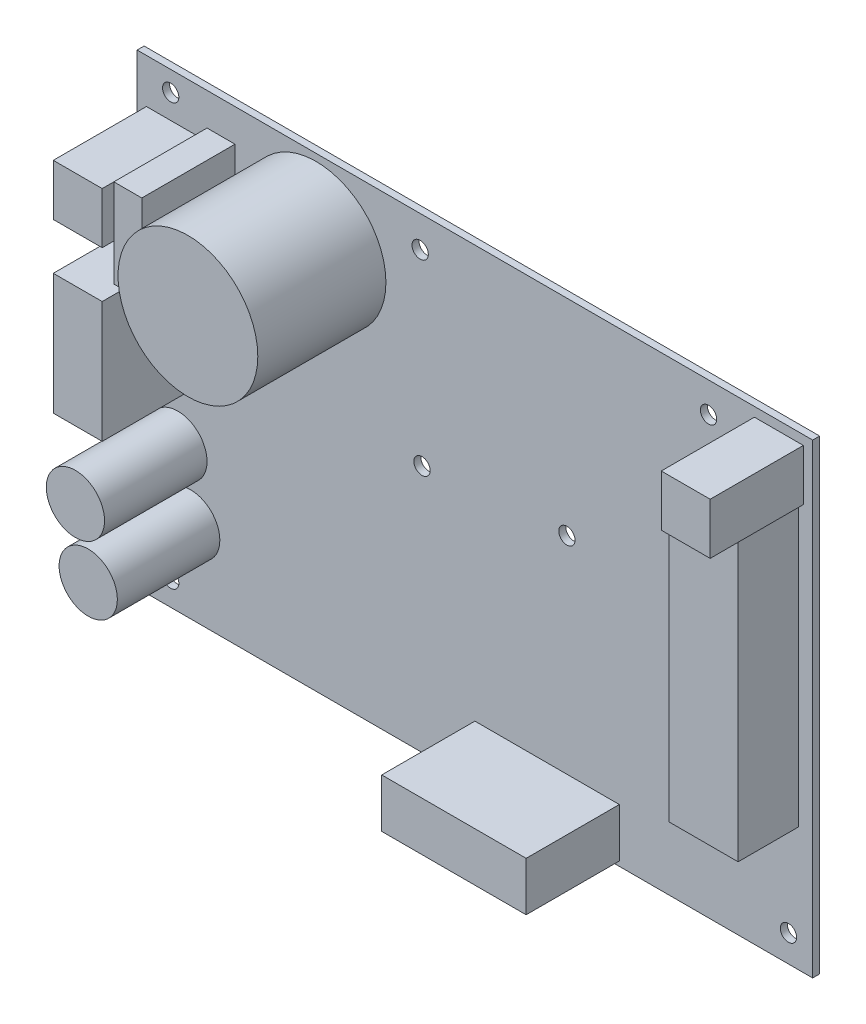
from build123d import *

# Parameters (mm, degrees)
SKICA1_W                  = 145
SKICA1_H                  = 100
SKICA1_R                  = 1.75
P_IDAT_VYSUNUT_M1_DEPTH   = 1.5
SKICA2_W                  = 10.5
SKICA2_H                  = 11
SKICA2_H_2                = 26
SKICA2_W_2                = 31
SKICA2_H_3                = 10.5
SKICA2_W_3                = 6
SKICA2_H_4                = 19
P_IDAT_VYSUNUT_M2_DEPTH   = 20
SKICA3_R                  = 15
P_IDAT_VYSUNUT_M3_DEPTH   = 27.5
SKICA4_W                  = 14.8
SKICA4_H                  = 60
P_IDAT_VYSUNUT_M4_DEPTH   = 13
SKICA6_R                  = 6.25
P_IDAT_VYSUNUT_M5_DEPTH   = 22
P_IDAT_VYSUNUT_M5_2_DEPTH = 22


with BuildPart() as part:
    # Skica1 → P_idat vysunut_m1 (new body)
    with BuildSketch(Plane.XY):
        with Locations((29.410747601, 13.45358419)):
            Rectangle(SKICA1_W, SKICA1_H)
        with Locations((-35.889252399, 59.15358419)):
            Circle(SKICA1_R, mode=Mode.SUBTRACT)
        with Locations((-35.889252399, -31.24641581)):
            Circle(SKICA1_R, mode=Mode.SUBTRACT)
        with Locations((96.710747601, -30.74641581)):
            Circle(SKICA1_R, mode=Mode.SUBTRACT)
        with Locations((78.660747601, 43.00358419)):
            Circle(SKICA1_R, mode=Mode.SUBTRACT)
        with Locations((79.560747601, 57.00358419)):
            Circle(SKICA1_R, mode=Mode.SUBTRACT)
        with Locations((49.160747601, 19.30358419)):
            Circle(SKICA1_R, mode=Mode.SUBTRACT)
        with Locations((18.060747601, 16.70358419)):
            Circle(SKICA1_R, mode=Mode.SUBTRACT)
        with Locations((17.660747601, 56.70358419)):
            Circle(SKICA1_R, mode=Mode.SUBTRACT)
    extrude(amount=P_IDAT_VYSUNUT_M1_DEPTH)

    # Skica2 → P_idat vysunut_m2 (add)
    with BuildSketch(Plane.XY.offset(1.5)):
        with Locations((-35.839252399, 48.45358419)):
            Rectangle(SKICA2_W, SKICA2_H)
        with Locations((-35.839252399, 19.95358419)):
            Rectangle(SKICA2_W, SKICA2_H_2)
        with Locations((94.660747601, 55.95358419)):
            Rectangle(SKICA2_W, SKICA2_H)
        with Locations((44.910747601, -30.29641581)):
            Rectangle(SKICA2_W_2, SKICA2_H_3)
        with Locations((-25.089252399, 46.95358419)):
            Rectangle(SKICA2_W_3, SKICA2_H_4)
    extrude(amount=P_IDAT_VYSUNUT_M2_DEPTH)

    # Skica3 → P_idat vysunut_m3 (add)
    with BuildSketch(Plane.XY.offset(1.5)):
        with Locations((-4.689252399, 46.95358419)):
            Circle(SKICA3_R)
    extrude(amount=P_IDAT_VYSUNUT_M3_DEPTH)

    # Skica4 → P_idat vysunut_m4 (add)
    with BuildSketch(Plane.XY.offset(1.5)):
        with Locations((91.510747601, 20.05358419)):
            Rectangle(SKICA4_W, SKICA4_H)
    extrude(amount=P_IDAT_VYSUNUT_M4_DEPTH)


with BuildPart() as body_2:
    # Skica6 → P_idat vysunut_m5 (new body)
    with BuildSketch(Plane.XY.offset(1.5)):
        with Locations((-34.339252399, -5.54641581)):
            Circle(SKICA6_R)
    extrude(amount=P_IDAT_VYSUNUT_M5_DEPTH)


with BuildPart() as body_3:
    # Skica6 → P_idat vysunut_m5 2 (new body)
    with BuildSketch(Plane.XY.offset(1.5)):
        with Locations((-31.589252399, -18.79641581)):
            Circle(SKICA6_R)
    extrude(amount=P_IDAT_VYSUNUT_M5_2_DEPTH)


solid = Compound([part.part, body_2.part, body_3.part])
